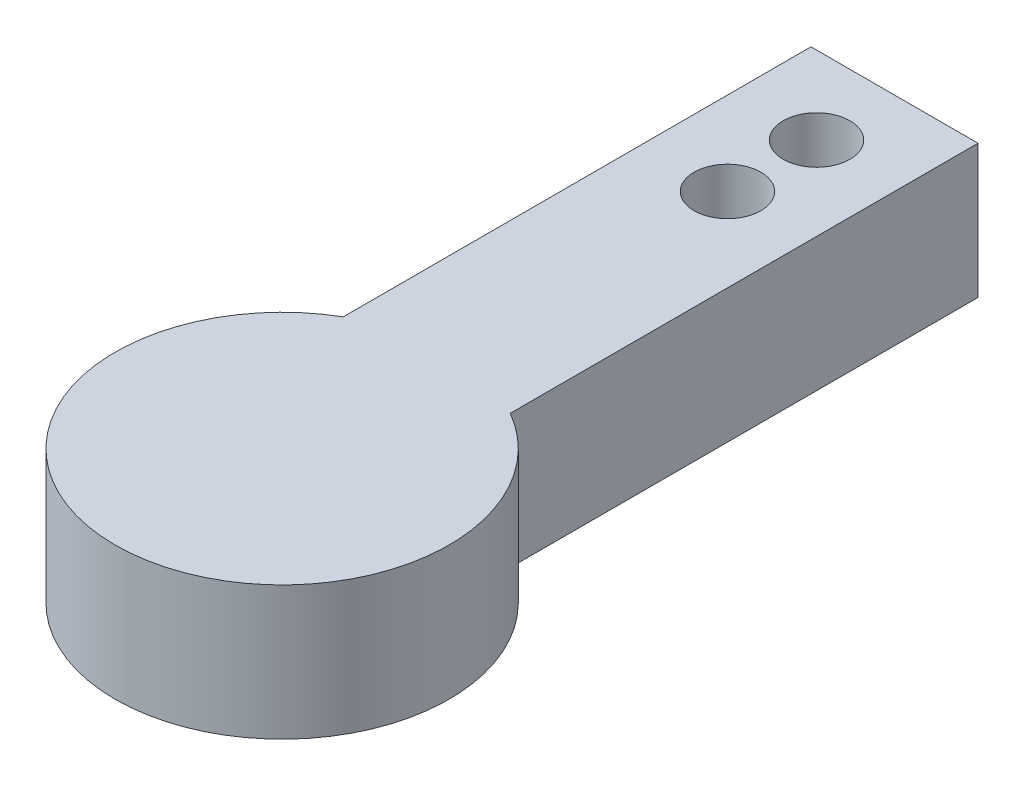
ISO-10303-21;
HEADER;
FILE_DESCRIPTION(('STEP AP214'),'2;1');
FILE_NAME('part.step','',(''),(''),'','','');
FILE_SCHEMA(('AUTOMOTIVE_DESIGN { 1 0 10303 214 1 1 1 1 }'));
ENDSEC;
DATA;
#1=APPLICATION_CONTEXT('core data for automotive mechanical design processes');
#2=APPLICATION_PROTOCOL_DEFINITION('international standard','automotive_design',2000,#1);
#3=PRODUCT_CONTEXT('',#1,'mechanical');
#4=PRODUCT('Part','Part','',(#3));
#5=PRODUCT_RELATED_PRODUCT_CATEGORY('part','',(#4));
#6=PRODUCT_DEFINITION_FORMATION('','',#4);
#7=PRODUCT_DEFINITION_CONTEXT('part definition',#1,'design');
#8=PRODUCT_DEFINITION('design','',#6,#7);
#9=PRODUCT_DEFINITION_SHAPE('','',#8);
#10=(LENGTH_UNIT() NAMED_UNIT(*) SI_UNIT(.MILLI.,.METRE.));
#11=(NAMED_UNIT(*) PLANE_ANGLE_UNIT() SI_UNIT($,.RADIAN.));
#12=(NAMED_UNIT(*) SI_UNIT($,.STERADIAN.) SOLID_ANGLE_UNIT());
#13=UNCERTAINTY_MEASURE_WITH_UNIT(LENGTH_MEASURE(1.E-05),#10,'distance_accuracy_value','');
#14=(GEOMETRIC_REPRESENTATION_CONTEXT(3) GLOBAL_UNCERTAINTY_ASSIGNED_CONTEXT((#13)) GLOBAL_UNIT_ASSIGNED_CONTEXT((#10,
#11,#12)) REPRESENTATION_CONTEXT('',''));
#15=CARTESIAN_POINT('',(0.,0.,0.));
#16=DIRECTION('',(0.,0.,1.));
#17=DIRECTION('',(1.,0.,0.));
#18=AXIS2_PLACEMENT_3D('',#15,#16,#17);
#19=CARTESIAN_POINT('',(0.,6.,0.));
#20=DIRECTION('',(0.,-1.,0.));
#21=DIRECTION('',(0.,0.,-1.));
#22=AXIS2_PLACEMENT_3D('',#19,#20,#21);
#23=CYLINDRICAL_SURFACE('',#22,3.);
#24=CARTESIAN_POINT('',(0.,0.,0.));
#25=DIRECTION('',(0.,-1.,0.));
#26=DIRECTION('',(0.,0.,-1.));
#27=AXIS2_PLACEMENT_3D('',#24,#25,#26);
#28=CIRCLE('',#27,3.);
#29=CARTESIAN_POINT('',(0.,0.,-3.));
#30=VERTEX_POINT('',#29);
#31=EDGE_CURVE('E123',#30,#30,#28,.T.);
#32=ORIENTED_EDGE('',*,*,#31,.T.);
#33=EDGE_LOOP('',(#32));
#34=FACE_BOUND('',#33,.T.);
#35=CARTESIAN_POINT('',(0.,5.,0.));
#36=DIRECTION('',(0.,1.,0.));
#37=DIRECTION('',(0.,0.,1.));
#38=AXIS2_PLACEMENT_3D('',#35,#36,#37);
#39=CIRCLE('',#38,3.);
#40=CARTESIAN_POINT('',(0.,5.,3.));
#41=VERTEX_POINT('',#40);
#42=EDGE_CURVE('E11',#41,#41,#39,.F.);
#43=ORIENTED_EDGE('',*,*,#42,.F.);
#44=EDGE_LOOP('',(#43));
#45=FACE_BOUND('',#44,.T.);
#46=ADVANCED_FACE('F45',(#34,#45),#23,.F.);
#47=CARTESIAN_POINT('',(3.75,6.,0.));
#48=DIRECTION('',(1.,0.,0.));
#49=DIRECTION('',(0.,0.,-1.));
#50=AXIS2_PLACEMENT_3D('',#47,#48,#49);
#51=PLANE('',#50);
#52=DIRECTION('',(0.,0.,1.));
#53=VECTOR('',#52,1.);
#54=CARTESIAN_POINT('',(3.75,0.,0.));
#55=LINE('',#54,#53);
#56=CARTESIAN_POINT('',(3.74999999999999,0.,-27.5));
#57=VERTEX_POINT('',#56);
#58=CARTESIAN_POINT('',(3.75,0.,-6.49519052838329));
#59=VERTEX_POINT('',#58);
#60=EDGE_CURVE('E119',#57,#59,#55,.T.);
#61=ORIENTED_EDGE('',*,*,#60,.F.);
#62=DIRECTION('',(0.,-1.,0.));
#63=VECTOR('',#62,1.);
#64=CARTESIAN_POINT('',(3.74999999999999,6.,-27.5));
#65=LINE('',#64,#63);
#66=CARTESIAN_POINT('',(3.74999999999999,6.,-27.5));
#67=VERTEX_POINT('',#66);
#68=EDGE_CURVE('E55',#67,#57,#65,.T.);
#69=ORIENTED_EDGE('',*,*,#68,.F.);
#70=DIRECTION('',(0.,0.,1.));
#71=VECTOR('',#70,1.);
#72=CARTESIAN_POINT('',(3.75,6.,0.));
#73=LINE('',#72,#71);
#74=CARTESIAN_POINT('',(3.75,6.,-6.49519052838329));
#75=VERTEX_POINT('',#74);
#76=EDGE_CURVE('E109',#67,#75,#73,.T.);
#77=ORIENTED_EDGE('',*,*,#76,.T.);
#78=DIRECTION('',(0.,-1.,0.));
#79=VECTOR('',#78,1.);
#80=CARTESIAN_POINT('',(3.75,6.,-6.49519052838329));
#81=LINE('',#80,#79);
#82=EDGE_CURVE('E86',#75,#59,#81,.T.);
#83=ORIENTED_EDGE('',*,*,#82,.T.);
#84=EDGE_LOOP('',(#61,#69,#77,#83));
#85=FACE_BOUND('',#84,.T.);
#86=ADVANCED_FACE('F47',(#85),#51,.T.);
#87=CARTESIAN_POINT('',(0.,6.,-27.5));
#88=DIRECTION('',(0.,0.,-1.));
#89=DIRECTION('',(-1.,0.,0.));
#90=AXIS2_PLACEMENT_3D('',#87,#88,#89);
#91=PLANE('',#90);
#92=DIRECTION('',(1.,0.,0.));
#93=VECTOR('',#92,1.);
#94=CARTESIAN_POINT('',(0.,0.,-27.5));
#95=LINE('',#94,#93);
#96=CARTESIAN_POINT('',(-3.75000000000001,0.,-27.5));
#97=VERTEX_POINT('',#96);
#98=EDGE_CURVE('E100',#97,#57,#95,.T.);
#99=ORIENTED_EDGE('',*,*,#98,.F.);
#100=DIRECTION('',(0.,-1.,0.));
#101=VECTOR('',#100,1.);
#102=CARTESIAN_POINT('',(-3.75000000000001,6.,-27.5));
#103=LINE('',#102,#101);
#104=CARTESIAN_POINT('',(-3.75000000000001,6.,-27.5));
#105=VERTEX_POINT('',#104);
#106=EDGE_CURVE('E94',#105,#97,#103,.T.);
#107=ORIENTED_EDGE('',*,*,#106,.F.);
#108=DIRECTION('',(1.,0.,0.));
#109=VECTOR('',#108,1.);
#110=CARTESIAN_POINT('',(0.,6.,-27.5));
#111=LINE('',#110,#109);
#112=EDGE_CURVE('E98',#105,#67,#111,.T.);
#113=ORIENTED_EDGE('',*,*,#112,.T.);
#114=ORIENTED_EDGE('',*,*,#68,.T.);
#115=EDGE_LOOP('',(#99,#107,#113,#114));
#116=FACE_BOUND('',#115,.T.);
#117=ADVANCED_FACE('F96',(#116),#91,.T.);
#118=CARTESIAN_POINT('',(-3.75,6.,0.));
#119=DIRECTION('',(1.,0.,0.));
#120=DIRECTION('',(0.,0.,-1.));
#121=AXIS2_PLACEMENT_3D('',#118,#119,#120);
#122=PLANE('',#121);
#123=DIRECTION('',(0.,0.,1.));
#124=VECTOR('',#123,1.);
#125=CARTESIAN_POINT('',(-3.75,0.,0.));
#126=LINE('',#125,#124);
#127=CARTESIAN_POINT('',(-3.75,0.,-6.49519052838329));
#128=VERTEX_POINT('',#127);
#129=EDGE_CURVE('E79',#97,#128,#126,.T.);
#130=ORIENTED_EDGE('',*,*,#129,.T.);
#131=DIRECTION('',(0.,-1.,0.));
#132=VECTOR('',#131,1.);
#133=CARTESIAN_POINT('',(-3.75,6.,-6.49519052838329));
#134=LINE('',#133,#132);
#135=CARTESIAN_POINT('',(-3.75,6.,-6.49519052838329));
#136=VERTEX_POINT('',#135);
#137=EDGE_CURVE('E102',#136,#128,#134,.T.);
#138=ORIENTED_EDGE('',*,*,#137,.F.);
#139=DIRECTION('',(0.,0.,1.));
#140=VECTOR('',#139,1.);
#141=CARTESIAN_POINT('',(-3.75,6.,0.));
#142=LINE('',#141,#140);
#143=EDGE_CURVE('E104',#105,#136,#142,.T.);
#144=ORIENTED_EDGE('',*,*,#143,.F.);
#145=ORIENTED_EDGE('',*,*,#106,.T.);
#146=EDGE_LOOP('',(#130,#138,#144,#145));
#147=FACE_BOUND('',#146,.T.);
#148=ADVANCED_FACE('F105',(#147),#122,.F.);
#149=CARTESIAN_POINT('',(0.,6.,0.));
#150=DIRECTION('',(0.,-1.,0.));
#151=DIRECTION('',(0.,0.,-1.));
#152=AXIS2_PLACEMENT_3D('',#149,#150,#151);
#153=CYLINDRICAL_SURFACE('',#152,7.5);
#154=CARTESIAN_POINT('',(0.,0.,0.));
#155=DIRECTION('',(0.,1.,0.));
#156=DIRECTION('',(0.,0.,1.));
#157=AXIS2_PLACEMENT_3D('',#154,#155,#156);
#158=CIRCLE('',#157,7.5);
#159=EDGE_CURVE('E113',#128,#59,#158,.T.);
#160=ORIENTED_EDGE('',*,*,#159,.T.);
#161=ORIENTED_EDGE('',*,*,#82,.F.);
#162=CARTESIAN_POINT('',(0.,6.,0.));
#163=DIRECTION('',(0.,1.,0.));
#164=DIRECTION('',(0.,0.,1.));
#165=AXIS2_PLACEMENT_3D('',#162,#163,#164);
#166=CIRCLE('',#165,7.5);
#167=EDGE_CURVE('E63',#136,#75,#166,.T.);
#168=ORIENTED_EDGE('',*,*,#167,.F.);
#169=ORIENTED_EDGE('',*,*,#137,.T.);
#170=EDGE_LOOP('',(#160,#161,#168,#169));
#171=FACE_BOUND('',#170,.T.);
#172=ADVANCED_FACE('F138',(#171),#153,.T.);
#173=CARTESIAN_POINT('',(0.,6.,0.));
#174=DIRECTION('',(0.,1.,0.));
#175=DIRECTION('',(0.,0.,1.));
#176=AXIS2_PLACEMENT_3D('',#173,#174,#175);
#177=PLANE('',#176);
#178=CARTESIAN_POINT('',(0.,6.,-20.));
#179=DIRECTION('',(0.,-1.,0.));
#180=DIRECTION('',(0.,0.,-1.));
#181=AXIS2_PLACEMENT_3D('',#178,#179,#180);
#182=CIRCLE('',#181,1.5);
#183=CARTESIAN_POINT('',(0.,6.,-21.5));
#184=VERTEX_POINT('',#183);
#185=EDGE_CURVE('E182',#184,#184,#182,.T.);
#186=ORIENTED_EDGE('',*,*,#185,.T.);
#187=EDGE_LOOP('',(#186));
#188=FACE_BOUND('',#187,.T.);
#189=CARTESIAN_POINT('',(0.,6.,-24.));
#190=DIRECTION('',(0.,-1.,0.));
#191=DIRECTION('',(0.,0.,-1.));
#192=AXIS2_PLACEMENT_3D('',#189,#190,#191);
#193=CIRCLE('',#192,1.5);
#194=CARTESIAN_POINT('',(0.,6.,-25.5));
#195=VERTEX_POINT('',#194);
#196=EDGE_CURVE('E183',#195,#195,#193,.T.);
#197=ORIENTED_EDGE('',*,*,#196,.T.);
#198=EDGE_LOOP('',(#197));
#199=FACE_BOUND('',#198,.T.);
#200=ORIENTED_EDGE('',*,*,#76,.F.);
#201=ORIENTED_EDGE('',*,*,#112,.F.);
#202=ORIENTED_EDGE('',*,*,#143,.T.);
#203=ORIENTED_EDGE('',*,*,#167,.T.);
#204=EDGE_LOOP('',(#200,#201,#202,#203));
#205=FACE_BOUND('',#204,.T.);
#206=ADVANCED_FACE('F108',(#188,#199,#205),#177,.T.);
#207=CARTESIAN_POINT('',(0.,0.,0.));
#208=DIRECTION('',(0.,1.,0.));
#209=DIRECTION('',(0.,0.,1.));
#210=AXIS2_PLACEMENT_3D('',#207,#208,#209);
#211=PLANE('',#210);
#212=ORIENTED_EDGE('',*,*,#31,.F.);
#213=EDGE_LOOP('',(#212));
#214=FACE_BOUND('',#213,.T.);
#215=CARTESIAN_POINT('',(0.,0.,-20.));
#216=DIRECTION('',(0.,-1.,0.));
#217=DIRECTION('',(0.,0.,-1.));
#218=AXIS2_PLACEMENT_3D('',#215,#216,#217);
#219=CIRCLE('',#218,1.5);
#220=CARTESIAN_POINT('',(0.,0.,-21.5));
#221=VERTEX_POINT('',#220);
#222=EDGE_CURVE('E176',#221,#221,#219,.T.);
#223=ORIENTED_EDGE('',*,*,#222,.F.);
#224=EDGE_LOOP('',(#223));
#225=FACE_BOUND('',#224,.T.);
#226=CARTESIAN_POINT('',(0.,0.,-24.));
#227=DIRECTION('',(0.,-1.,0.));
#228=DIRECTION('',(0.,0.,-1.));
#229=AXIS2_PLACEMENT_3D('',#226,#227,#228);
#230=CIRCLE('',#229,1.5);
#231=CARTESIAN_POINT('',(0.,0.,-25.5));
#232=VERTEX_POINT('',#231);
#233=EDGE_CURVE('E179',#232,#232,#230,.T.);
#234=ORIENTED_EDGE('',*,*,#233,.F.);
#235=EDGE_LOOP('',(#234));
#236=FACE_BOUND('',#235,.T.);
#237=ORIENTED_EDGE('',*,*,#60,.T.);
#238=ORIENTED_EDGE('',*,*,#159,.F.);
#239=ORIENTED_EDGE('',*,*,#129,.F.);
#240=ORIENTED_EDGE('',*,*,#98,.T.);
#241=EDGE_LOOP('',(#237,#238,#239,#240));
#242=FACE_BOUND('',#241,.T.);
#243=ADVANCED_FACE('F136',(#214,#225,#236,#242),#211,.F.);
#244=CARTESIAN_POINT('',(0.,6.,-24.));
#245=DIRECTION('',(0.,-1.,0.));
#246=DIRECTION('',(0.,0.,-1.));
#247=AXIS2_PLACEMENT_3D('',#244,#245,#246);
#248=CYLINDRICAL_SURFACE('',#247,1.5);
#249=ORIENTED_EDGE('',*,*,#196,.F.);
#250=EDGE_LOOP('',(#249));
#251=FACE_BOUND('',#250,.T.);
#252=ORIENTED_EDGE('',*,*,#233,.T.);
#253=EDGE_LOOP('',(#252));
#254=FACE_BOUND('',#253,.T.);
#255=ADVANCED_FACE('F163',(#251,#254),#248,.F.);
#256=CARTESIAN_POINT('',(0.,6.,-20.));
#257=DIRECTION('',(0.,-1.,0.));
#258=DIRECTION('',(0.,0.,-1.));
#259=AXIS2_PLACEMENT_3D('',#256,#257,#258);
#260=CYLINDRICAL_SURFACE('',#259,1.5);
#261=ORIENTED_EDGE('',*,*,#185,.F.);
#262=EDGE_LOOP('',(#261));
#263=FACE_BOUND('',#262,.T.);
#264=ORIENTED_EDGE('',*,*,#222,.T.);
#265=EDGE_LOOP('',(#264));
#266=FACE_BOUND('',#265,.T.);
#267=ADVANCED_FACE('F160',(#263,#266),#260,.F.);
#268=CARTESIAN_POINT('',(0.,5.,0.));
#269=DIRECTION('',(0.,1.,0.));
#270=DIRECTION('',(0.,0.,1.));
#271=AXIS2_PLACEMENT_3D('',#268,#269,#270);
#272=PLANE('',#271);
#273=ORIENTED_EDGE('',*,*,#42,.T.);
#274=EDGE_LOOP('',(#273));
#275=FACE_BOUND('',#274,.T.);
#276=ADVANCED_FACE('F159',(#275),#272,.F.);
#277=CLOSED_SHELL('',(#46,#86,#117,#148,#172,#206,#243,#255,#267,#276));
#278=MANIFOLD_SOLID_BREP('B2',#277);
#279=ADVANCED_BREP_SHAPE_REPRESENTATION('',(#18,#278),#14);
#280=SHAPE_DEFINITION_REPRESENTATION(#9,#279);
ENDSEC;
END-ISO-10303-21;
